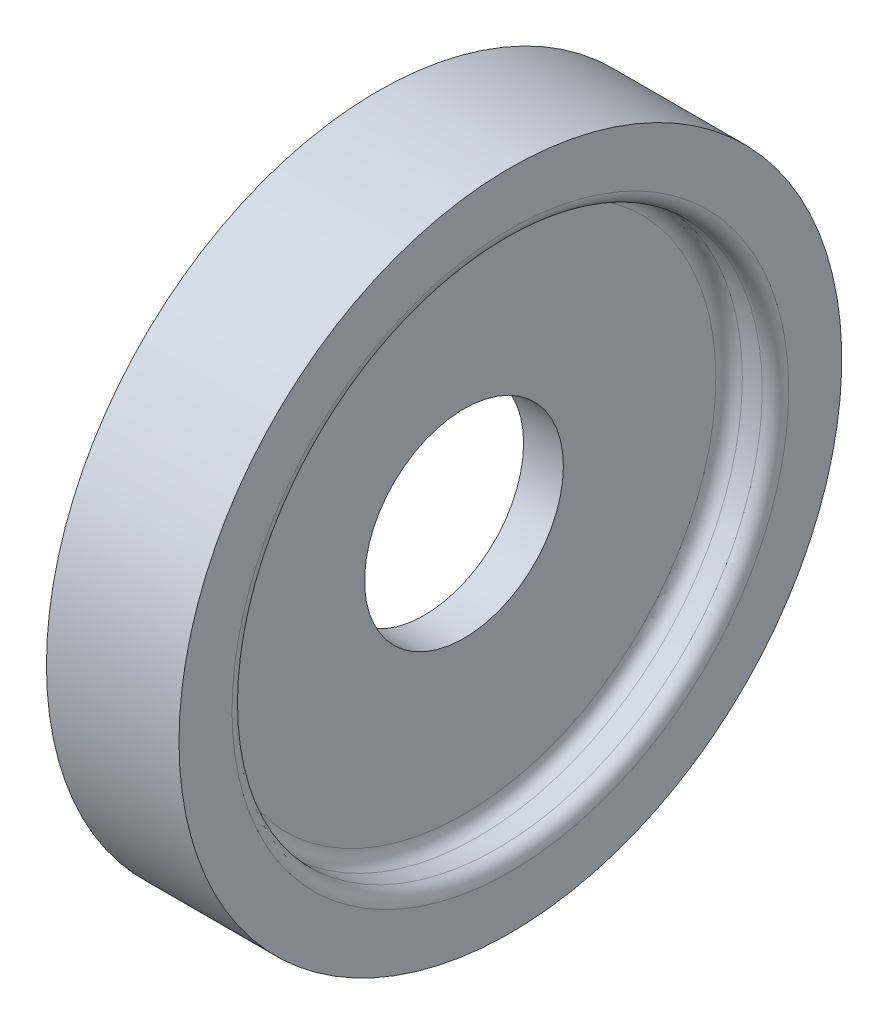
ISO-10303-21;
HEADER;
FILE_DESCRIPTION(('STEP AP214'),'2;1');
FILE_NAME('part.step','',(''),(''),'','','');
FILE_SCHEMA(('AUTOMOTIVE_DESIGN { 1 0 10303 214 1 1 1 1 }'));
ENDSEC;
DATA;
#1=APPLICATION_CONTEXT('core data for automotive mechanical design processes');
#2=APPLICATION_PROTOCOL_DEFINITION('international standard','automotive_design',2000,#1);
#3=PRODUCT_CONTEXT('',#1,'mechanical');
#4=PRODUCT('Part','Part','',(#3));
#5=PRODUCT_RELATED_PRODUCT_CATEGORY('part','',(#4));
#6=PRODUCT_DEFINITION_FORMATION('','',#4);
#7=PRODUCT_DEFINITION_CONTEXT('part definition',#1,'design');
#8=PRODUCT_DEFINITION('design','',#6,#7);
#9=PRODUCT_DEFINITION_SHAPE('','',#8);
#10=(LENGTH_UNIT() NAMED_UNIT(*) SI_UNIT(.MILLI.,.METRE.));
#11=(NAMED_UNIT(*) PLANE_ANGLE_UNIT() SI_UNIT($,.RADIAN.));
#12=(NAMED_UNIT(*) SI_UNIT($,.STERADIAN.) SOLID_ANGLE_UNIT());
#13=UNCERTAINTY_MEASURE_WITH_UNIT(LENGTH_MEASURE(1.E-05),#10,'distance_accuracy_value','');
#14=(GEOMETRIC_REPRESENTATION_CONTEXT(3) GLOBAL_UNCERTAINTY_ASSIGNED_CONTEXT((#13)) GLOBAL_UNIT_ASSIGNED_CONTEXT((#10,
#11,#12)) REPRESENTATION_CONTEXT('',''));
#15=CARTESIAN_POINT('',(0.,0.,0.));
#16=DIRECTION('',(0.,0.,1.));
#17=DIRECTION('',(1.,0.,0.));
#18=AXIS2_PLACEMENT_3D('',#15,#16,#17);
#19=CARTESIAN_POINT('',(-1.5,19.,0.));
#20=DIRECTION('',(1.,0.,0.));
#21=DIRECTION('',(0.,0.,-1.));
#22=AXIS2_PLACEMENT_3D('',#19,#20,#21);
#23=PLANE('',#22);
#24=CARTESIAN_POINT('',(-1.5,0.,0.));
#25=DIRECTION('',(1.,0.,0.));
#26=DIRECTION('',(0.,0.,-1.));
#27=AXIS2_PLACEMENT_3D('',#24,#25,#26);
#28=CIRCLE('',#27,7.5);
#29=CARTESIAN_POINT('',(-1.5,0.,-7.5));
#30=VERTEX_POINT('',#29);
#31=EDGE_CURVE('E67',#30,#30,#28,.F.);
#32=ORIENTED_EDGE('',*,*,#31,.F.);
#33=EDGE_LOOP('',(#32));
#34=FACE_BOUND('',#33,.T.);
#35=CARTESIAN_POINT('',(-1.5,0.,0.));
#36=DIRECTION('',(-1.,0.,0.));
#37=DIRECTION('',(0.,0.,1.));
#38=AXIS2_PLACEMENT_3D('',#35,#36,#37);
#39=CIRCLE('',#38,19.);
#40=CARTESIAN_POINT('',(-1.5,0.,19.));
#41=VERTEX_POINT('',#40);
#42=EDGE_CURVE('E10',#41,#41,#39,.T.);
#43=ORIENTED_EDGE('',*,*,#42,.T.);
#44=EDGE_LOOP('',(#43));
#45=FACE_BOUND('',#44,.T.);
#46=ADVANCED_FACE('F30',(#34,#45),#23,.F.);
#47=CARTESIAN_POINT('',(-2.5,0.,0.));
#48=DIRECTION('',(-1.,0.,0.));
#49=DIRECTION('',(0.,0.,1.));
#50=AXIS2_PLACEMENT_3D('',#47,#48,#49);
#51=TOROIDAL_SURFACE('',#50,19.,0.999999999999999);
#52=ORIENTED_EDGE('',*,*,#42,.F.);
#53=EDGE_LOOP('',(#52));
#54=FACE_BOUND('',#53,.T.);
#55=CARTESIAN_POINT('',(-2.5,0.,0.));
#56=DIRECTION('',(-1.,0.,0.));
#57=DIRECTION('',(0.,0.,1.));
#58=AXIS2_PLACEMENT_3D('',#55,#56,#57);
#59=CIRCLE('',#58,20.);
#60=CARTESIAN_POINT('',(-2.5,0.,20.));
#61=VERTEX_POINT('',#60);
#62=EDGE_CURVE('E36',#61,#61,#59,.T.);
#63=ORIENTED_EDGE('',*,*,#62,.T.);
#64=EDGE_LOOP('',(#63));
#65=FACE_BOUND('',#64,.T.);
#66=ADVANCED_FACE('F96',(#54,#65),#51,.F.);
#67=CARTESIAN_POINT('',(-24.4139620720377,0.,0.));
#68=DIRECTION('',(-1.,0.,0.));
#69=DIRECTION('',(0.,0.,1.));
#70=AXIS2_PLACEMENT_3D('',#67,#68,#69);
#71=CYLINDRICAL_SURFACE('',#70,20.);
#72=ORIENTED_EDGE('',*,*,#62,.F.);
#73=EDGE_LOOP('',(#72));
#74=FACE_BOUND('',#73,.T.);
#75=CARTESIAN_POINT('',(-4.,0.,0.));
#76=DIRECTION('',(-1.,0.,0.));
#77=DIRECTION('',(0.,0.,1.));
#78=AXIS2_PLACEMENT_3D('',#75,#76,#77);
#79=CIRCLE('',#78,20.);
#80=CARTESIAN_POINT('',(-4.,0.,20.));
#81=VERTEX_POINT('',#80);
#82=EDGE_CURVE('E40',#81,#81,#79,.T.);
#83=ORIENTED_EDGE('',*,*,#82,.T.);
#84=EDGE_LOOP('',(#83));
#85=FACE_BOUND('',#84,.T.);
#86=ADVANCED_FACE('F101',(#74,#85),#71,.F.);
#87=CARTESIAN_POINT('',(-4.,0.,0.));
#88=DIRECTION('',(-1.,0.,0.));
#89=DIRECTION('',(0.,0.,1.));
#90=AXIS2_PLACEMENT_3D('',#87,#88,#89);
#91=TOROIDAL_SURFACE('',#90,21.,1.);
#92=ORIENTED_EDGE('',*,*,#82,.F.);
#93=EDGE_LOOP('',(#92));
#94=FACE_BOUND('',#93,.T.);
#95=CARTESIAN_POINT('',(-5.,0.,0.));
#96=DIRECTION('',(-1.,0.,0.));
#97=DIRECTION('',(0.,0.,1.));
#98=AXIS2_PLACEMENT_3D('',#95,#96,#97);
#99=CIRCLE('',#98,21.);
#100=CARTESIAN_POINT('',(-5.,0.,21.));
#101=VERTEX_POINT('',#100);
#102=EDGE_CURVE('E44',#101,#101,#99,.T.);
#103=ORIENTED_EDGE('',*,*,#102,.T.);
#104=EDGE_LOOP('',(#103));
#105=FACE_BOUND('',#104,.T.);
#106=ADVANCED_FACE('F166',(#94,#105),#91,.T.);
#107=CARTESIAN_POINT('',(-5.,25.,0.));
#108=DIRECTION('',(1.,0.,0.));
#109=DIRECTION('',(0.,0.,-1.));
#110=AXIS2_PLACEMENT_3D('',#107,#108,#109);
#111=PLANE('',#110);
#112=ORIENTED_EDGE('',*,*,#102,.F.);
#113=EDGE_LOOP('',(#112));
#114=FACE_BOUND('',#113,.T.);
#115=CARTESIAN_POINT('',(-5.,0.,0.));
#116=DIRECTION('',(-1.,0.,0.));
#117=DIRECTION('',(0.,0.,1.));
#118=AXIS2_PLACEMENT_3D('',#115,#116,#117);
#119=CIRCLE('',#118,25.);
#120=CARTESIAN_POINT('',(-5.,0.,25.));
#121=VERTEX_POINT('',#120);
#122=EDGE_CURVE('E49',#121,#121,#119,.T.);
#123=ORIENTED_EDGE('',*,*,#122,.T.);
#124=EDGE_LOOP('',(#123));
#125=FACE_BOUND('',#124,.T.);
#126=ADVANCED_FACE('F156',(#114,#125),#111,.F.);
#127=CARTESIAN_POINT('',(-24.4139620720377,0.,0.));
#128=DIRECTION('',(-1.,0.,0.));
#129=DIRECTION('',(0.,0.,1.));
#130=AXIS2_PLACEMENT_3D('',#127,#128,#129);
#131=CYLINDRICAL_SURFACE('',#130,25.);
#132=ORIENTED_EDGE('',*,*,#122,.F.);
#133=EDGE_LOOP('',(#132));
#134=FACE_BOUND('',#133,.T.);
#135=CARTESIAN_POINT('',(5.,0.,0.));
#136=DIRECTION('',(-1.,0.,0.));
#137=DIRECTION('',(0.,0.,1.));
#138=AXIS2_PLACEMENT_3D('',#135,#136,#137);
#139=CIRCLE('',#138,25.);
#140=CARTESIAN_POINT('',(5.,0.,25.));
#141=VERTEX_POINT('',#140);
#142=EDGE_CURVE('E52',#141,#141,#139,.T.);
#143=ORIENTED_EDGE('',*,*,#142,.T.);
#144=EDGE_LOOP('',(#143));
#145=FACE_BOUND('',#144,.T.);
#146=ADVANCED_FACE('F146',(#134,#145),#131,.T.);
#147=CARTESIAN_POINT('',(5.,21.,0.));
#148=DIRECTION('',(-1.,0.,0.));
#149=DIRECTION('',(0.,0.,1.));
#150=AXIS2_PLACEMENT_3D('',#147,#148,#149);
#151=PLANE('',#150);
#152=ORIENTED_EDGE('',*,*,#142,.F.);
#153=EDGE_LOOP('',(#152));
#154=FACE_BOUND('',#153,.T.);
#155=CARTESIAN_POINT('',(5.,0.,0.));
#156=DIRECTION('',(-1.,0.,0.));
#157=DIRECTION('',(0.,0.,1.));
#158=AXIS2_PLACEMENT_3D('',#155,#156,#157);
#159=CIRCLE('',#158,21.);
#160=CARTESIAN_POINT('',(5.,0.,21.));
#161=VERTEX_POINT('',#160);
#162=EDGE_CURVE('E55',#161,#161,#159,.T.);
#163=ORIENTED_EDGE('',*,*,#162,.T.);
#164=EDGE_LOOP('',(#163));
#165=FACE_BOUND('',#164,.T.);
#166=ADVANCED_FACE('F136',(#154,#165),#151,.F.);
#167=CARTESIAN_POINT('',(4.,0.,0.));
#168=DIRECTION('',(-1.,0.,0.));
#169=DIRECTION('',(0.,0.,1.));
#170=AXIS2_PLACEMENT_3D('',#167,#168,#169);
#171=TOROIDAL_SURFACE('',#170,21.,1.);
#172=ORIENTED_EDGE('',*,*,#162,.F.);
#173=EDGE_LOOP('',(#172));
#174=FACE_BOUND('',#173,.T.);
#175=CARTESIAN_POINT('',(4.,0.,0.));
#176=DIRECTION('',(-1.,0.,0.));
#177=DIRECTION('',(0.,0.,1.));
#178=AXIS2_PLACEMENT_3D('',#175,#176,#177);
#179=CIRCLE('',#178,20.);
#180=CARTESIAN_POINT('',(4.,0.,20.));
#181=VERTEX_POINT('',#180);
#182=EDGE_CURVE('E58',#181,#181,#179,.T.);
#183=ORIENTED_EDGE('',*,*,#182,.T.);
#184=EDGE_LOOP('',(#183));
#185=FACE_BOUND('',#184,.T.);
#186=ADVANCED_FACE('F91',(#174,#185),#171,.T.);
#187=CARTESIAN_POINT('',(-24.4139620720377,0.,0.));
#188=DIRECTION('',(-1.,0.,0.));
#189=DIRECTION('',(0.,0.,1.));
#190=AXIS2_PLACEMENT_3D('',#187,#188,#189);
#191=CYLINDRICAL_SURFACE('',#190,20.);
#192=ORIENTED_EDGE('',*,*,#182,.F.);
#193=EDGE_LOOP('',(#192));
#194=FACE_BOUND('',#193,.T.);
#195=CARTESIAN_POINT('',(2.5,0.,0.));
#196=DIRECTION('',(-1.,0.,0.));
#197=DIRECTION('',(0.,0.,1.));
#198=AXIS2_PLACEMENT_3D('',#195,#196,#197);
#199=CIRCLE('',#198,20.);
#200=CARTESIAN_POINT('',(2.5,0.,20.));
#201=VERTEX_POINT('',#200);
#202=EDGE_CURVE('E61',#201,#201,#199,.T.);
#203=ORIENTED_EDGE('',*,*,#202,.T.);
#204=EDGE_LOOP('',(#203));
#205=FACE_BOUND('',#204,.T.);
#206=ADVANCED_FACE('F85',(#194,#205),#191,.F.);
#207=CARTESIAN_POINT('',(2.5,0.,0.));
#208=DIRECTION('',(-1.,0.,0.));
#209=DIRECTION('',(0.,0.,1.));
#210=AXIS2_PLACEMENT_3D('',#207,#208,#209);
#211=TOROIDAL_SURFACE('',#210,19.,0.999999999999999);
#212=ORIENTED_EDGE('',*,*,#202,.F.);
#213=EDGE_LOOP('',(#212));
#214=FACE_BOUND('',#213,.T.);
#215=CARTESIAN_POINT('',(1.49999999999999,0.,0.));
#216=DIRECTION('',(-1.,0.,0.));
#217=DIRECTION('',(0.,0.,1.));
#218=AXIS2_PLACEMENT_3D('',#215,#216,#217);
#219=CIRCLE('',#218,19.);
#220=CARTESIAN_POINT('',(1.49999999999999,0.,19.));
#221=VERTEX_POINT('',#220);
#222=EDGE_CURVE('E64',#221,#221,#219,.T.);
#223=ORIENTED_EDGE('',*,*,#222,.T.);
#224=EDGE_LOOP('',(#223));
#225=FACE_BOUND('',#224,.T.);
#226=ADVANCED_FACE('F80',(#214,#225),#211,.F.);
#227=CARTESIAN_POINT('',(1.5,0.,0.));
#228=DIRECTION('',(-1.,0.,0.));
#229=DIRECTION('',(0.,0.,1.));
#230=AXIS2_PLACEMENT_3D('',#227,#228,#229);
#231=PLANE('',#230);
#232=CARTESIAN_POINT('',(1.5,0.,0.));
#233=DIRECTION('',(1.,0.,0.));
#234=DIRECTION('',(0.,0.,-1.));
#235=AXIS2_PLACEMENT_3D('',#232,#233,#234);
#236=CIRCLE('',#235,7.5);
#237=CARTESIAN_POINT('',(1.5,0.,-7.5));
#238=VERTEX_POINT('',#237);
#239=EDGE_CURVE('E70',#238,#238,#236,.T.);
#240=ORIENTED_EDGE('',*,*,#239,.F.);
#241=EDGE_LOOP('',(#240));
#242=FACE_BOUND('',#241,.T.);
#243=ORIENTED_EDGE('',*,*,#222,.F.);
#244=EDGE_LOOP('',(#243));
#245=FACE_BOUND('',#244,.T.);
#246=ADVANCED_FACE('F77',(#242,#245),#231,.F.);
#247=CARTESIAN_POINT('',(-5.001,0.,0.));
#248=DIRECTION('',(1.,0.,0.));
#249=DIRECTION('',(0.,0.,-1.));
#250=AXIS2_PLACEMENT_3D('',#247,#248,#249);
#251=CYLINDRICAL_SURFACE('',#250,7.5);
#252=ORIENTED_EDGE('',*,*,#239,.T.);
#253=EDGE_LOOP('',(#252));
#254=FACE_BOUND('',#253,.T.);
#255=ORIENTED_EDGE('',*,*,#31,.T.);
#256=EDGE_LOOP('',(#255));
#257=FACE_BOUND('',#256,.T.);
#258=ADVANCED_FACE('F74',(#254,#257),#251,.F.);
#259=CLOSED_SHELL('',(#46,#66,#86,#106,#126,#146,#166,#186,#206,#226,#246,#258));
#260=MANIFOLD_SOLID_BREP('B2',#259);
#261=ADVANCED_BREP_SHAPE_REPRESENTATION('',(#18,#260),#14);
#262=SHAPE_DEFINITION_REPRESENTATION(#9,#261);
ENDSEC;
END-ISO-10303-21;
